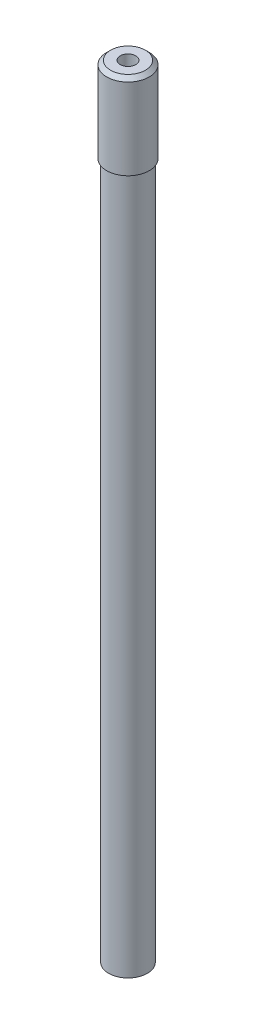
from build123d import *

# Parameters (mm, degrees)
ESQUISSE1_R             = 2.75
BOSS_EXTRU_1_DEPTH      = 11
CHANFREIN1_SIZE         = 0.5
ESQUISSE2_R             = 2.5
BOSS_EXTRU_2_DEPTH      = 90
ESQUISSE3_R             = 1
ENL_V_MAT_EXTRU_1_DEPTH = 102.074848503


with BuildPart() as part:
    # Esquisse1 → Boss.-Extru.1 (new body)
    with BuildSketch(Plane(origin=(0, 0, 0), x_dir=(1, 0, 0), z_dir=(0, 1, 0))):
        with Locations(Location((0, 0, 0), (0, 0, 270))):
            Circle(ESQUISSE1_R)
    extrude(amount=BOSS_EXTRU_1_DEPTH)

    # Chanfrein1
    chanfrein1_edges = [part.edges().sort_by_distance(p)[0] for p in [
        (0, 11, -2.75),
    ]]
    chamfer(chanfrein1_edges, length=CHANFREIN1_SIZE)

    # Esquisse2 → Boss.-Extru.2 (add)
    with BuildSketch(Plane.XZ):
        with Locations(Location((0, 0, 0), (0, 0, 90))):
            Circle(ESQUISSE2_R)
    extrude(amount=BOSS_EXTRU_2_DEPTH)

    # Esquisse3 → Enl_v. mat.-Extru.1 (cut, through all)
    with BuildSketch(Plane(origin=(0, 11, 0), x_dir=(1, 0, 0), z_dir=(0, 1, 0))):
        with Locations(Location((0, 0, 0), (0, 0, 270))):
            Circle(ESQUISSE3_R)
    extrude(amount=-ENL_V_MAT_EXTRU_1_DEPTH, mode=Mode.SUBTRACT)


solid = part.part
